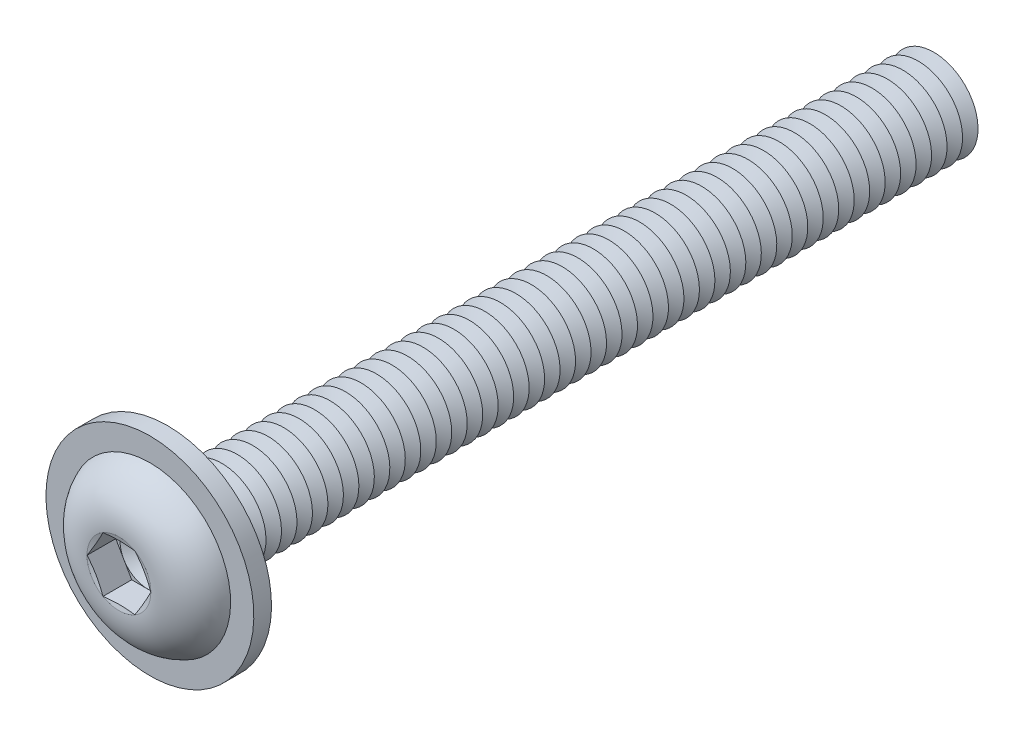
from build123d import *

# Parameters (mm, degrees)
FILLET1_R           = 0.35
LPATTERN1_COUNT     = 50
LPATTERN1_PITCH     = 0.7
CUT_EXTRUDE1_DEPTH  = 1.3
SKETCH5_R           = 4.7
SKETCH5_R_2         = 2.35
BOSS_EXTRUDE1_DEPTH = 0.8


with BuildPart() as part:
    # Sketch1 → Revolve1 (revolve)
    with BuildSketch(Plane(origin=(0, 0, 0), x_dir=(0, 0, -1), z_dir=(1, 0, 0))):
        with BuildLine():
            Line((0, 2), (0, 3.8))
            ThreePointArc((0, 3.8), (-1.611961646, 3.099623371), (-2.2, 1.443375))
            Line((-2.2, 1.443375), (-2.006624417, 0.7216875))
            Line((-2.006624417, 0.7216875), (-2.2, 0.7216875))
            Line((-2.2, 0.7216875), (-2.2, 0))
            Line((-2.2, 0), (35, 0))
            Line((35, 0), (35, 2))
            Line((35, 2), (0, 2))
        make_face()
    revolve(axis=Axis((0, 0, -35), (0, 0, 1)))

    # Fillet1
    fillet1_edges = [part.edges().sort_by_distance(p)[0] for p in [
        (0, -2, 0),
    ]]
    fillet(fillet1_edges, radius=FILLET1_R)

    # Sketch2 → Cut-Revolve1 (revolve, cut)
    with BuildSketch(Plane(origin=(0, 0, 0), x_dir=(0, 0, -1), z_dir=(1, 0, 0))):
        Polygon((34.65, 2), (35.35, 2), (35, 1.393782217), align=None)
    cut_revolve1 = revolve(axis=Axis((0, 0, -35), (0, 0, -1)), mode=Mode.SUBTRACT)

    # LPattern1: Cut-Revolve1 ×50
    with Locations(*[(0, 0, i * LPATTERN1_PITCH) for i in range(1, LPATTERN1_COUNT)]):
        add(cut_revolve1, mode=Mode.SUBTRACT)

    # Sketch3 → Cut-Extrude1 (cut)
    with BuildSketch(Plane.XY.offset(2.2)):
        Polygon((0.7216875, 1.249999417), (-0.7216875, 1.249999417), (-1.443375, 0), (-0.7216875, -1.249999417), (0.7216875, -1.249999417), (1.443375, 0), align=None)
    extrude(amount=-CUT_EXTRUDE1_DEPTH, mode=Mode.SUBTRACT)

    # Cut-Extrude2 cone 1 section (on through the dimple's axis) → Cut-Extrude2 (revolve, cut)
    with BuildSketch(Plane(origin=(0, 0, 0.9), x_dir=(0, -1, 0), z_dir=(1, 0, 0))):
        Polygon((0, 0), (1.249999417, 0), (0, 0.7216875), align=None)
    revolve(axis=Axis((0, 0, 0.9), (0, 0, -1)), mode=Mode.SUBTRACT)

    # Sketch5 → Boss-Extrude1 (add)
    with BuildSketch(Plane(origin=(0, 0, 0), x_dir=(-1, 0, 0), z_dir=(0, 0, -1))):
        with Locations(Location((0, 0, 0), (0, 0, 90))):
            Circle(SKETCH5_R)
        Circle(SKETCH5_R_2, mode=Mode.SUBTRACT)
    extrude(amount=-BOSS_EXTRUDE1_DEPTH)


solid = part.part
